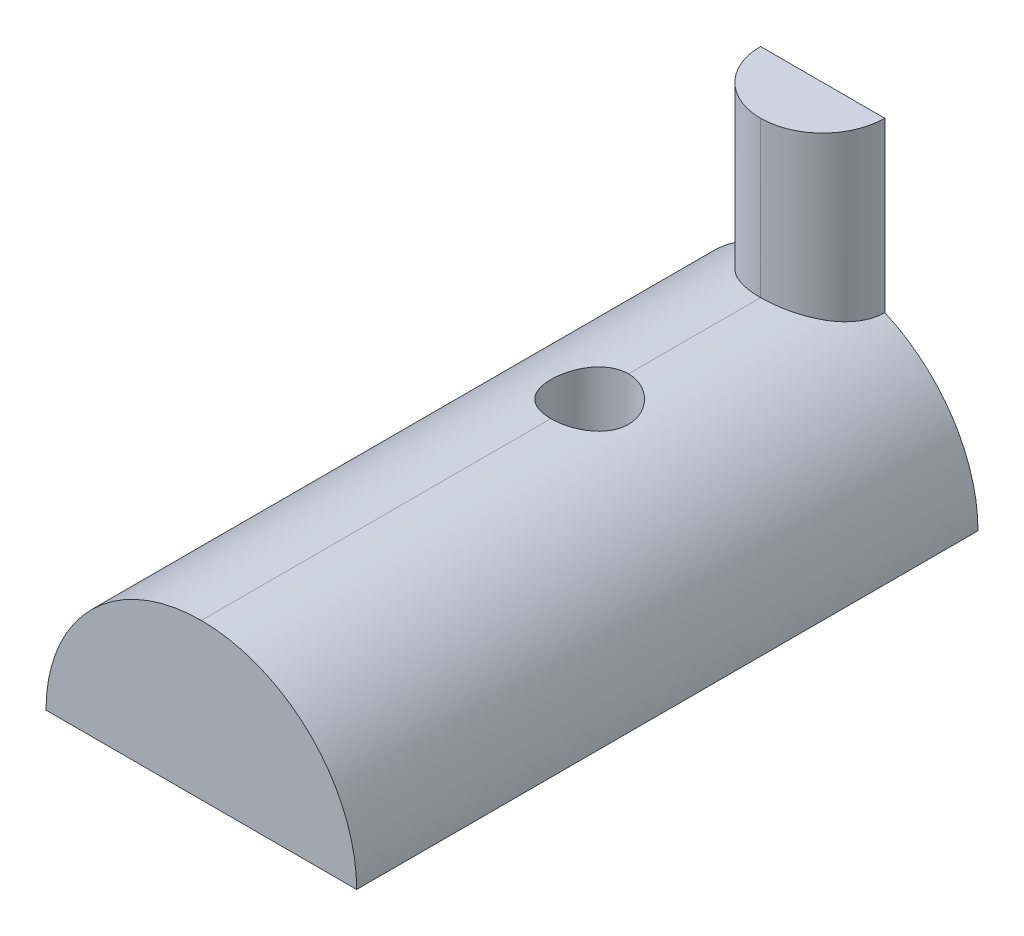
ISO-10303-21;
HEADER;
FILE_DESCRIPTION(('STEP AP214'),'2;1');
FILE_NAME('part.step','',(''),(''),'','','');
FILE_SCHEMA(('AUTOMOTIVE_DESIGN { 1 0 10303 214 1 1 1 1 }'));
ENDSEC;
DATA;
#1=APPLICATION_CONTEXT('core data for automotive mechanical design processes');
#2=APPLICATION_PROTOCOL_DEFINITION('international standard','automotive_design',2000,#1);
#3=PRODUCT_CONTEXT('',#1,'mechanical');
#4=PRODUCT('Part','Part','',(#3));
#5=PRODUCT_RELATED_PRODUCT_CATEGORY('part','',(#4));
#6=PRODUCT_DEFINITION_FORMATION('','',#4);
#7=PRODUCT_DEFINITION_CONTEXT('part definition',#1,'design');
#8=PRODUCT_DEFINITION('design','',#6,#7);
#9=PRODUCT_DEFINITION_SHAPE('','',#8);
#10=(LENGTH_UNIT() NAMED_UNIT(*) SI_UNIT(.MILLI.,.METRE.));
#11=(NAMED_UNIT(*) PLANE_ANGLE_UNIT() SI_UNIT($,.RADIAN.));
#12=(NAMED_UNIT(*) SI_UNIT($,.STERADIAN.) SOLID_ANGLE_UNIT());
#13=UNCERTAINTY_MEASURE_WITH_UNIT(LENGTH_MEASURE(1.E-05),#10,'distance_accuracy_value','');
#14=(GEOMETRIC_REPRESENTATION_CONTEXT(3) GLOBAL_UNCERTAINTY_ASSIGNED_CONTEXT((#13)) GLOBAL_UNIT_ASSIGNED_CONTEXT((#10,
#11,#12)) REPRESENTATION_CONTEXT('',''));
#15=CARTESIAN_POINT('',(0.,0.,0.));
#16=DIRECTION('',(0.,0.,1.));
#17=DIRECTION('',(1.,0.,0.));
#18=AXIS2_PLACEMENT_3D('',#15,#16,#17);
#19=CARTESIAN_POINT('',(0.,2540.,0.));
#20=DIRECTION('',(0.,-1.,0.));
#21=DIRECTION('',(0.,0.,-1.));
#22=AXIS2_PLACEMENT_3D('',#19,#20,#21);
#23=CYLINDRICAL_SURFACE('',#22,508.);
#24=CARTESIAN_POINT('',(508.,1163.97422651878,1.77635683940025E-12));
#25=CARTESIAN_POINT('',(508.000002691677,1163.97421948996,3.41657036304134));
#26=CARTESIAN_POINT('',(507.96553124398,1163.98927063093,6.83303695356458));
#27=CARTESIAN_POINT('',(507.827685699,1164.04941899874,13.6642900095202));
#28=CARTESIAN_POINT('',(507.724312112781,1164.09451600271,17.0790764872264));
#29=CARTESIAN_POINT('',(507.310928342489,1164.27476094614,27.318225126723));
#30=CARTESIAN_POINT('',(506.897655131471,1164.45486283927,34.1379353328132));
#31=CARTESIAN_POINT('',(505.797076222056,1164.93333604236,47.7484560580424));
#32=CARTESIAN_POINT('',(505.109872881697,1165.23166317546,54.5392764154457));
#33=CARTESIAN_POINT('',(503.875094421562,1165.76587971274,64.6956183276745));
#34=CARTESIAN_POINT('',(503.429498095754,1165.95840961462,68.0761329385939));
#35=CARTESIAN_POINT('',(502.470583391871,1166.37197565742,74.8260226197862));
#36=CARTESIAN_POINT('',(501.957260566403,1166.59301367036,78.195396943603));
#37=CARTESIAN_POINT('',(500.320603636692,1167.29632361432,88.2573007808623));
#38=CARTESIAN_POINT('',(499.097253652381,1167.820235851,94.9309441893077));
#39=CARTESIAN_POINT('',(496.386406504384,1168.9750659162,108.215019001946));
#40=CARTESIAN_POINT('',(494.898907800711,1169.60598436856,114.825450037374));
#41=CARTESIAN_POINT('',(492.472444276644,1170.62874519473,124.685008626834));
#42=CARTESIAN_POINT('',(491.631021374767,1170.98242346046,127.96240789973));
#43=CARTESIAN_POINT('',(489.883670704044,1171.71450726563,134.496939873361));
#44=CARTESIAN_POINT('',(488.977747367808,1172.09291110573,137.754073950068));
#45=CARTESIAN_POINT('',(486.163889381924,1173.26416734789,147.493541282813));
#46=CARTESIAN_POINT('',(484.159831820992,1174.09307924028,153.94408152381));
#47=CARTESIAN_POINT('',(479.902748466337,1175.83954560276,166.741654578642));
#48=CARTESIAN_POINT('',(477.650011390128,1176.75699712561,173.088797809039));
#49=CARTESIAN_POINT('',(472.898571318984,1178.67446906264,185.677688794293));
#50=CARTESIAN_POINT('',(470.399868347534,1179.67448946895,191.919436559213));
#51=CARTESIAN_POINT('',(465.161723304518,1181.74976471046,204.288221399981));
#52=CARTESIAN_POINT('',(462.422284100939,1182.82501864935,210.415259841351));
#53=CARTESIAN_POINT('',(456.708029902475,1185.04310814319,222.546015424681));
#54=CARTESIAN_POINT('',(453.733214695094,1186.18594375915,228.549732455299));
#55=CARTESIAN_POINT('',(447.550882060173,1188.53235046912,240.431052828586));
#56=CARTESIAN_POINT('',(444.34316396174,1189.73597365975,246.308541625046));
#57=CARTESIAN_POINT('',(439.36328176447,1191.5800600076,255.019794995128));
#58=CARTESIAN_POINT('',(437.675252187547,1192.20120389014,257.906078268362));
#59=CARTESIAN_POINT('',(434.243631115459,1193.45540613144,263.64301907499));
#60=CARTESIAN_POINT('',(432.500036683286,1194.08846511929,266.493674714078));
#61=CARTESIAN_POINT('',(427.187130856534,1196.00390075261,274.990514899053));
#62=CARTESIAN_POINT('',(423.535521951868,1197.30260102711,280.581878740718));
#63=CARTESIAN_POINT('',(416.018946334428,1199.93503733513,291.610654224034));
#64=CARTESIAN_POINT('',(412.153976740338,1201.26877384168,297.048063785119));
#65=CARTESIAN_POINT('',(404.012474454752,1204.03211589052,308.037418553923));
#66=CARTESIAN_POINT('',(399.724999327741,1205.46312773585,313.580910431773));
#67=CARTESIAN_POINT('',(390.927093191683,1208.3449152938,324.482776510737));
#68=CARTESIAN_POINT('',(386.416660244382,1209.79569117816,329.841149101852));
#69=CARTESIAN_POINT('',(377.179505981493,1212.70733150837,340.365457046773));
#70=CARTESIAN_POINT('',(372.452778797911,1214.16819622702,345.53138717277));
#71=CARTESIAN_POINT('',(362.789808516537,1217.09039507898,355.663548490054));
#72=CARTESIAN_POINT('',(357.853566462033,1218.55172920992,360.629780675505));
#73=CARTESIAN_POINT('',(350.297111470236,1220.73699580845,367.924171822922));
#74=CARTESIAN_POINT('',(347.752580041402,1221.46439626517,370.330133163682));
#75=CARTESIAN_POINT('',(342.613932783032,1222.91570469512,375.089264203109));
#76=CARTESIAN_POINT('',(340.019819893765,1223.63961287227,377.44243701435));
#77=CARTESIAN_POINT('',(332.164116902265,1225.80443174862,384.421737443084));
#78=CARTESIAN_POINT('',(326.829045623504,1227.23847067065,388.967759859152));
#79=CARTESIAN_POINT('',(315.970969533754,1230.07879425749,397.838531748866));
#80=CARTESIAN_POINT('',(310.447961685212,1231.48507847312,402.163277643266));
#81=CARTESIAN_POINT('',(299.221543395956,1234.26087246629,410.584588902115));
#82=CARTESIAN_POINT('',(293.518131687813,1235.63038198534,414.681152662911));
#83=CARTESIAN_POINT('',(281.709508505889,1238.37713969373,422.79675117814));
#84=CARTESIAN_POINT('',(275.597331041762,1239.75254387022,426.806280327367));
#85=CARTESIAN_POINT('',(263.196175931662,1242.44437757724,434.563301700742));
#86=CARTESIAN_POINT('',(256.907197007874,1243.76080668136,438.310792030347));
#87=CARTESIAN_POINT('',(244.162243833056,1246.32541982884,445.536149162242));
#88=CARTESIAN_POINT('',(237.706262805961,1247.57360109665,449.01400500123));
#89=CARTESIAN_POINT('',(224.638225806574,1249.99272912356,455.692341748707));
#90=CARTESIAN_POINT('',(218.026170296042,1251.16367611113,458.8928234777));
#91=CARTESIAN_POINT('',(204.659412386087,1253.41950242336,465.008090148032));
#92=CARTESIAN_POINT('',(197.904756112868,1254.50440905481,467.922965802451));
#93=CARTESIAN_POINT('',(184.262740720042,1256.58061626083,473.461123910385));
#94=CARTESIAN_POINT('',(177.375381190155,1257.57191654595,476.084405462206));
#95=CARTESIAN_POINT('',(163.481065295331,1259.45348715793,481.032558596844));
#96=CARTESIAN_POINT('',(156.474114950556,1260.34376255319,483.357445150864));
#97=CARTESIAN_POINT('',(142.353770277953,1262.01661911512,487.702746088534));
#98=CARTESIAN_POINT('',(135.24037718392,1262.79920152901,489.72316399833));
#99=CARTESIAN_POINT('',(121.267982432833,1264.21555557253,493.363602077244));
#100=CARTESIAN_POINT('',(114.413338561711,1264.85469753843,494.998271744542));
#101=CARTESIAN_POINT('',(100.63321057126,1266.02558048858,497.982584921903));
#102=CARTESIAN_POINT('',(93.7077271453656,1266.55732252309,499.332231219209));
#103=CARTESIAN_POINT('',(79.7992406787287,1267.50963241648,501.742856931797));
#104=CARTESIAN_POINT('',(72.8162387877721,1267.93020249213,502.803842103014));
#105=CARTESIAN_POINT('',(58.8061858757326,1268.65717769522,504.634263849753));
#106=CARTESIAN_POINT('',(51.7791347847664,1268.9635826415,505.40369996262));
#107=CARTESIAN_POINT('',(37.6970531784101,1269.45994620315,506.648676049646));
#108=CARTESIAN_POINT('',(30.6420316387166,1269.64993954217,507.12430366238));
#109=CARTESIAN_POINT('',(16.5160751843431,1269.91224968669,507.780673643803));
#110=CARTESIAN_POINT('',(9.44514023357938,1269.98456622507,507.961415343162));
#111=CARTESIAN_POINT('',(-4.69810803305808,1270.01099788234,508.02749487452));
#112=CARTESIAN_POINT('',(-11.7704213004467,1269.96511659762,507.9128416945));
#113=CARTESIAN_POINT('',(-25.9022950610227,1269.75549135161,507.388476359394));
#114=CARTESIAN_POINT('',(-32.9618556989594,1269.59174873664,506.978767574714));
#115=CARTESIAN_POINT('',(-46.6574628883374,1269.16009440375,505.896803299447));
#116=CARTESIAN_POINT('',(-53.2949871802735,1268.89856294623,505.240619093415));
#117=CARTESIAN_POINT('',(-66.5342551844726,1268.27327843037,503.668173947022));
#118=CARTESIAN_POINT('',(-73.1359992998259,1267.90952652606,502.751915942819));
#119=CARTESIAN_POINT('',(-86.291918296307,1267.08213797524,500.661627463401));
#120=CARTESIAN_POINT('',(-92.8460953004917,1266.61850581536,499.487608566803));
#121=CARTESIAN_POINT('',(-105.895982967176,1265.5942787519,496.88460417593));
#122=CARTESIAN_POINT('',(-112.39169343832,1265.03368353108,495.45561784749));
#123=CARTESIAN_POINT('',(-125.313837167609,1263.81903671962,492.346022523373));
#124=CARTESIAN_POINT('',(-131.74026956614,1263.16498397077,490.665410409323));
#125=CARTESIAN_POINT('',(-144.513306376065,1261.76748280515,487.056411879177));
#126=CARTESIAN_POINT('',(-150.859910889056,1261.02403450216,485.128025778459));
#127=CARTESIAN_POINT('',(-163.46341065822,1259.45227951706,481.027680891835));
#128=CARTESIAN_POINT('',(-169.720304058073,1258.62397108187,478.855717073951));
#129=CARTESIAN_POINT('',(-182.134696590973,1256.88751935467,474.272846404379));
#130=CARTESIAN_POINT('',(-188.292195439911,1255.97937583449,471.861938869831));
#131=CARTESIAN_POINT('',(-200.590404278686,1254.0744746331,466.768091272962));
#132=CARTESIAN_POINT('',(-206.729472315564,1253.07659064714,464.081608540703));
#133=CARTESIAN_POINT('',(-218.886814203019,1251.01022427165,458.472875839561));
#134=CARTESIAN_POINT('',(-224.905087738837,1249.94174169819,455.550625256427));
#135=CARTESIAN_POINT('',(-236.812264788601,1247.74060127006,449.475941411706));
#136=CARTESIAN_POINT('',(-242.701168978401,1246.60794375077,446.323509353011));
#137=CARTESIAN_POINT('',(-254.341559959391,1244.28517431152,439.794160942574));
#138=CARTESIAN_POINT('',(-260.093046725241,1243.09506238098,436.417244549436));
#139=CARTESIAN_POINT('',(-271.452525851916,1240.66404515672,429.443774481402));
#140=CARTESIAN_POINT('',(-277.060478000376,1239.42312587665,425.847160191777));
#141=CARTESIAN_POINT('',(-288.123944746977,1236.89805044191,418.441041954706));
#142=CARTESIAN_POINT('',(-293.579459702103,1235.6138943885,414.631538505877));
#143=CARTESIAN_POINT('',(-304.331335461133,1233.00974663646,406.805422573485));
#144=CARTESIAN_POINT('',(-309.627691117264,1231.68975378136,402.788803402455));
#145=CARTESIAN_POINT('',(-320.054421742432,1229.02161424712,394.554558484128));
#146=CARTESIAN_POINT('',(-325.184795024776,1227.67346728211,390.336930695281));
#147=CARTESIAN_POINT('',(-335.604470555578,1224.86759529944,381.423223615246));
#148=CARTESIAN_POINT('',(-340.882104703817,1223.40848561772,376.713910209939));
#149=CARTESIAN_POINT('',(-348.645804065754,1221.20978558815,369.489650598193));
#150=CARTESIAN_POINT('',(-351.208286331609,1220.47520076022,367.054807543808));
#151=CARTESIAN_POINT('',(-356.281718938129,1219.00381994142,362.132337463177));
#152=CARTESIAN_POINT('',(-358.792666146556,1218.26702381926,359.644707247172));
#153=CARTESIAN_POINT('',(-366.24659081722,1216.05522059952,352.104239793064));
#154=CARTESIAN_POINT('',(-371.110861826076,1214.57873887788,346.97362986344));
#155=CARTESIAN_POINT('',(-380.621889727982,1211.63186002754,336.51292467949));
#156=CARTESIAN_POINT('',(-385.268646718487,1210.16146289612,331.182829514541));
#157=CARTESIAN_POINT('',(-392.071326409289,1207.96761405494,323.042705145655));
#158=CARTESIAN_POINT('',(-394.311563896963,1207.23809197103,320.304401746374));
#159=CARTESIAN_POINT('',(-398.734869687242,1205.78436009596,314.780910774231));
#160=CARTESIAN_POINT('',(-400.917941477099,1205.0601499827,311.995726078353));
#161=CARTESIAN_POINT('',(-407.380408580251,1202.89726991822,303.570923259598));
#162=CARTESIAN_POINT('',(-411.573158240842,1201.46831706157,297.861933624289));
#163=CARTESIAN_POINT('',(-419.720052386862,1198.64659643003,286.267844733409));
#164=CARTESIAN_POINT('',(-423.674199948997,1197.25382818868,280.382747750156));
#165=CARTESIAN_POINT('',(-431.337318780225,1194.514409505,268.444458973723));
#166=CARTESIAN_POINT('',(-435.046288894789,1193.16775927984,262.391266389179));
#167=CARTESIAN_POINT('',(-442.315595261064,1190.49248002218,249.948626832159));
#168=CARTESIAN_POINT('',(-445.868558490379,1189.16549118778,243.554517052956));
#169=CARTESIAN_POINT('',(-452.700452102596,1186.58149306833,230.607621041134));
#170=CARTESIAN_POINT('',(-455.979380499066,1185.32448429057,224.054833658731));
#171=CARTESIAN_POINT('',(-462.256400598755,1182.89067703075,210.800372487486));
#172=CARTESIAN_POINT('',(-465.25445529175,1181.71388912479,204.098679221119));
#173=CARTESIAN_POINT('',(-470.962190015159,1179.45073729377,190.558631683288));
#174=CARTESIAN_POINT('',(-473.671872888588,1178.36437247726,183.720278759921));
#175=CARTESIAN_POINT('',(-478.792229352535,1176.29316821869,169.929454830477));
#176=CARTESIAN_POINT('',(-481.203352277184,1175.30817659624,162.977173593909));
#177=CARTESIAN_POINT('',(-485.725090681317,1173.44668208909,148.960939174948));
#178=CARTESIAN_POINT('',(-487.835697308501,1172.57018240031,141.896982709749));
#179=CARTESIAN_POINT('',(-491.749625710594,1170.93415830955,127.674148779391));
#180=CARTESIAN_POINT('',(-493.553068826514,1170.17458772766,120.515310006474));
#181=CARTESIAN_POINT('',(-496.848258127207,1168.77928346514,106.114810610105));
#182=CARTESIAN_POINT('',(-498.340039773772,1168.14353569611,98.8731595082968));
#183=CARTESIAN_POINT('',(-500.364649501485,1167.277077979,87.8288475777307));
#184=CARTESIAN_POINT('',(-501.013155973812,1166.99882215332,84.050711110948));
#185=CARTESIAN_POINT('',(-502.224794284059,1166.47790049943,76.478461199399));
#186=CARTESIAN_POINT('',(-502.787930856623,1166.23523269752,72.6843486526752));
#187=CARTESIAN_POINT('',(-503.828237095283,1165.7861845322,65.0831744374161));
#188=CARTESIAN_POINT('',(-504.305427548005,1165.57979539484,61.2761161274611));
#189=CARTESIAN_POINT('',(-505.173597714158,1165.20378476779,53.6503714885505));
#190=CARTESIAN_POINT('',(-505.564577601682,1165.03416320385,49.8316851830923));
#191=CARTESIAN_POINT('',(-506.259764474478,1164.73224156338,42.1873388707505));
#192=CARTESIAN_POINT('',(-506.564025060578,1164.59991843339,38.3616846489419));
#193=CARTESIAN_POINT('',(-507.085824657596,1164.37281265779,30.7033728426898));
#194=CARTESIAN_POINT('',(-507.303364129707,1164.27802981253,26.8707152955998));
#195=CARTESIAN_POINT('',(-507.651575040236,1164.12624596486,19.1995729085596));
#196=CARTESIAN_POINT('',(-507.782220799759,1164.06925613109,15.3610866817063));
#197=CARTESIAN_POINT('',(-507.956440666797,1163.99323693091,7.6817343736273));
#198=CARTESIAN_POINT('',(-508.000014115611,1163.97420785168,3.8408682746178));
#199=CARTESIAN_POINT('',(-508.,1163.97422651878,1.75303813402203E-12));
#200=B_SPLINE_CURVE_WITH_KNOTS('',3,(#24,#25,#26,#27,#28,#29,#30,#31,#32,#33,#34,#35,#36,#37,
#38,#39,#40,#41,#42,#43,#44,#45,#46,#47,#48,#49,#50,#51,#52,#53,#54,#55,#56,#57,#58,#59,#60,#61,
#62,#63,#64,#65,#66,#67,#68,#69,#70,#71,#72,#73,#74,#75,#76,#77,#78,#79,#80,#81,#82,#83,#84,#85,
#86,#87,#88,#89,#90,#91,#92,#93,#94,#95,#96,#97,#98,#99,#100,#101,#102,#103,#104,#105,#106,#107,
#108,#109,#110,#111,#112,#113,#114,#115,#116,#117,#118,#119,#120,#121,#122,#123,#124,#125,#126,
#127,#128,#129,#130,#131,#132,#133,#134,#135,#136,#137,#138,#139,#140,#141,#142,#143,#144,#145,
#146,#147,#148,#149,#150,#151,#152,#153,#154,#155,#156,#157,#158,#159,#160,#161,#162,#163,#164,
#165,#166,#167,#168,#169,#170,#171,#172,#173,#174,#175,#176,#177,#178,#179,#180,#181,#182,#183,
#184,#185,#186,#187,#188,#189,#190,#191,#192,#193,#194,#195,#196,#197,#198,#199),.UNSPECIFIED.,
.F.,.F.,(4,2,2,2,2,2,2,2,2,2,2,2,2,2,2,2,2,2,2,2,2,2,2,2,2,2,2,2,2,2,2,2,2,2,2,2,2,2,2,2,2,2,2,
2,2,2,2,2,2,2,2,2,2,2,2,2,2,2,2,2,2,2,2,2,2,2,2,2,2,2,2,2,2,2,2,2,2,2,2,2,2,2,2,2,2,2,2,4),(0.,
10.2492969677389,20.498517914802,40.995284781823,61.4843998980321,71.7292542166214,
81.9747816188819,102.383189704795,122.791716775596,132.997410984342,143.202404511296,
163.611951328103,183.99804699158,204.38414070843,224.769991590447,245.155860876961,
265.559508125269,275.76153902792,285.964110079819,306.368177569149,326.772520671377,
348.224500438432,369.676666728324,391.129415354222,412.582057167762,423.311362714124,
434.040033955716,455.496879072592,476.954071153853,498.411414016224,520.719075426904,
543.026898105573,565.335627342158,587.644290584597,609.945845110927,632.247468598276,
654.547972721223,676.848218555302,698.068784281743,719.289142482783,740.509077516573,
761.729046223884,782.942682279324,804.156366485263,825.369405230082,846.582201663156,
866.601318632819,886.620209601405,906.638201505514,926.656258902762,946.674564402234,
966.69284442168,986.711538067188,1006.73028892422,1027.0497859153,1047.36933584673,
1067.68877959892,1088.00822709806,1108.33330628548,1128.65833787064,1148.98402613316,
1169.3099208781,1190.96982650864,1201.80013761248,1212.63110503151,1234.29215947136,
1255.95320420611,1266.78962665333,1277.62538650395,1299.29641632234,1320.96716663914,
1342.63801899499,1364.93394851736,1387.23003964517,1409.52906456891,1431.82786962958,
1454.09269611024,1476.35817830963,1498.6148443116,1520.86897650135,1532.39844988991,
1543.92728361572,1555.45332526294,1566.97934363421,1578.49822229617,1590.01703969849,
1601.53925963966,1613.06156674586),.UNSPECIFIED.);
#201=CARTESIAN_POINT('',(0.,1270.,508.));
#202=VERTEX_POINT('',#201);
#203=CARTESIAN_POINT('',(-508.,1163.97422651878,0.));
#204=VERTEX_POINT('',#203);
#205=EDGE_CURVE('E112',#202,#204,#200,.T.);
#206=ORIENTED_EDGE('',*,*,#205,.F.);
#207=DIRECTION('',(0.,1.,0.));
#208=VECTOR('',#207,1.);
#209=CARTESIAN_POINT('',(0.,2540.,508.));
#210=LINE('',#209,#208);
#211=CARTESIAN_POINT('',(0.,2540.,508.));
#212=VERTEX_POINT('',#211);
#213=EDGE_CURVE('E12',#202,#212,#210,.T.);
#214=ORIENTED_EDGE('',*,*,#213,.T.);
#215=CARTESIAN_POINT('',(0.,2540.,0.));
#216=DIRECTION('',(0.,-1.,0.));
#217=DIRECTION('',(0.,0.,-1.));
#218=AXIS2_PLACEMENT_3D('',#215,#216,#217);
#219=CIRCLE('',#218,508.);
#220=CARTESIAN_POINT('',(-508.,2540.,0.));
#221=VERTEX_POINT('',#220);
#222=EDGE_CURVE('E87',#212,#221,#219,.T.);
#223=ORIENTED_EDGE('',*,*,#222,.T.);
#224=DIRECTION('',(0.,-1.,0.));
#225=VECTOR('',#224,1.);
#226=CARTESIAN_POINT('',(-508.,2540.,0.));
#227=LINE('',#226,#225);
#228=EDGE_CURVE('E89',#221,#204,#227,.T.);
#229=ORIENTED_EDGE('',*,*,#228,.T.);
#230=EDGE_LOOP('',(#206,#214,#223,#229));
#231=FACE_BOUND('',#230,.T.);
#232=ADVANCED_FACE('F34',(#231),#23,.T.);
#233=CARTESIAN_POINT('',(0.,0.,5080.));
#234=DIRECTION('',(0.,0.,-1.));
#235=DIRECTION('',(-1.,0.,0.));
#236=AXIS2_PLACEMENT_3D('',#233,#234,#235);
#237=CYLINDRICAL_SURFACE('',#236,1270.);
#238=CARTESIAN_POINT('',(0.,1270.,1587.5));
#239=CARTESIAN_POINT('',(4.38598745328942,1269.99999869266,1587.50000235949));
#240=CARTESIAN_POINT('',(8.77206841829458,1269.97726514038,1587.59090207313));
#241=CARTESIAN_POINT('',(17.5363138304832,1269.88648495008,1587.95431701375));
#242=CARTESIAN_POINT('',(21.9144780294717,1269.81843691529,1588.22683783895));
#243=CARTESIAN_POINT('',(30.6552939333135,1269.63749282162,1588.95295145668));
#244=CARTESIAN_POINT('',(35.0179440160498,1269.52459220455,1589.40656265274));
#245=CARTESIAN_POINT('',(43.7193281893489,1269.25472903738,1590.49388809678));
#246=CARTESIAN_POINT('',(48.0580624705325,1269.09776683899,1591.12760090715));
#247=CARTESIAN_POINT('',(56.7060487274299,1268.74077826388,1592.57416261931));
#248=CARTESIAN_POINT('',(61.01528458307,1268.54073002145,1593.3871024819));
#249=CARTESIAN_POINT('',(69.5943598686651,1268.09900016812,1595.19023879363));
#250=CARTESIAN_POINT('',(73.8641992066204,1267.85731846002,1596.1804356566));
#251=CARTESIAN_POINT('',(82.3568088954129,1267.33399515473,1598.33601734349));
#252=CARTESIAN_POINT('',(86.5795806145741,1267.05235472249,1599.50139706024));
#253=CARTESIAN_POINT('',(94.9708141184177,1266.45104061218,1602.00500874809));
#254=CARTESIAN_POINT('',(99.1392759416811,1266.13136696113,1603.34324059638));
#255=CARTESIAN_POINT('',(107.40967384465,1265.45657963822,1606.18816624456));
#256=CARTESIAN_POINT('',(111.511684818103,1265.10150963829,1607.69465272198));
#257=CARTESIAN_POINT('',(119.647430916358,1264.3580103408,1610.87448638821));
#258=CARTESIAN_POINT('',(123.68116604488,1263.96958104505,1612.54783356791));
#259=CARTESIAN_POINT('',(131.673634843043,1263.16197976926,1616.05821594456));
#260=CARTESIAN_POINT('',(135.632368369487,1262.74280773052,1617.89525145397));
#261=CARTESIAN_POINT('',(143.468310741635,1261.87653207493,1621.72959926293));
#262=CARTESIAN_POINT('',(147.34551956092,1261.42942844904,1623.72691161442));
#263=CARTESIAN_POINT('',(155.012103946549,1260.51027493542,1627.87818555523));
#264=CARTESIAN_POINT('',(158.801479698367,1260.03822510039,1630.03214681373));
#265=CARTESIAN_POINT('',(166.286319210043,1259.0723169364,1634.49290142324));
#266=CARTESIAN_POINT('',(169.981783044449,1258.57845862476,1636.79969465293));
#267=CARTESIAN_POINT('',(177.272966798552,1257.57220036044,1641.56214013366));
#268=CARTESIAN_POINT('',(180.86868570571,1257.05980021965,1644.01779389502));
#269=CARTESIAN_POINT('',(187.954677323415,1256.01984970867,1649.07377428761));
#270=CARTESIAN_POINT('',(191.444949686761,1255.49229928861,1651.67410139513));
#271=CARTESIAN_POINT('',(198.378114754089,1254.41566367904,1657.064504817));
#272=CARTESIAN_POINT('',(201.818936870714,1253.86636065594,1659.85720127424));
#273=CARTESIAN_POINT('',(208.57993085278,1252.75941304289,1665.58344284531));
#274=CARTESIAN_POINT('',(211.900102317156,1252.20176842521,1668.51698842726));
#275=CARTESIAN_POINT('',(218.414426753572,1251.0819562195,1674.52005150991));
#276=CARTESIAN_POINT('',(221.608578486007,1250.51978858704,1677.58957034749));
#277=CARTESIAN_POINT('',(227.865613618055,1249.39480008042,1683.85948423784));
#278=CARTESIAN_POINT('',(230.928497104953,1248.83197920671,1687.05987920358));
#279=CARTESIAN_POINT('',(236.918288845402,1247.70950550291,1693.58667097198));
#280=CARTESIAN_POINT('',(239.845182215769,1247.14985302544,1696.91308149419));
#281=CARTESIAN_POINT('',(245.557766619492,1246.03766043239,1703.68616464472));
#282=CARTESIAN_POINT('',(248.343457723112,1245.48512031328,1707.13283721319));
#283=CARTESIAN_POINT('',(253.768955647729,1244.39100599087,1714.14087818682));
#284=CARTESIAN_POINT('',(256.408761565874,1243.84943185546,1717.7022473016));
#285=CARTESIAN_POINT('',(261.537941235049,1242.78106201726,1724.93388259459));
#286=CARTESIAN_POINT('',(264.027314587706,1242.25426635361,1728.60414906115));
#287=CARTESIAN_POINT('',(268.88721239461,1241.21147898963,1736.10306026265));
#288=CARTESIAN_POINT('',(271.25541313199,1240.69576525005,1739.93325004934));
#289=CARTESIAN_POINT('',(275.828001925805,1239.68721666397,1747.69315151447));
#290=CARTESIAN_POINT('',(278.032389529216,1239.19438188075,1751.62286346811));
#291=CARTESIAN_POINT('',(282.273215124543,1238.23525978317,1759.57514625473));
#292=CARTESIAN_POINT('',(284.309650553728,1237.76897287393,1763.59771850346));
#293=CARTESIAN_POINT('',(288.210585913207,1236.8664707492,1771.72869551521));
#294=CARTESIAN_POINT('',(290.075086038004,1236.43025549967,1775.83710018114));
#295=CARTESIAN_POINT('',(293.628234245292,1235.59127229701,1784.13203394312));
#296=CARTESIAN_POINT('',(295.316903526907,1235.18850031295,1788.31855354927));
#297=CARTESIAN_POINT('',(298.515208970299,1234.41944876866,1796.76274521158));
#298=CARTESIAN_POINT('',(300.024844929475,1234.05316924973,1801.02041734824));
#299=CARTESIAN_POINT('',(302.861903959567,1233.35996357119,1809.59912218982));
#300=CARTESIAN_POINT('',(304.189330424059,1233.03303667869,1813.92015371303));
#301=CARTESIAN_POINT('',(306.659165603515,1232.42110300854,1822.61770372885));
#302=CARTESIAN_POINT('',(307.80157510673,1232.1360960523,1826.99422198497));
#303=CARTESIAN_POINT('',(309.877880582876,1231.61553316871,1835.70642899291));
#304=CARTESIAN_POINT('',(310.815494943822,1231.37910103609,1840.04117953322));
#305=CARTESIAN_POINT('',(312.508658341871,1230.95048696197,1848.74826015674));
#306=CARTESIAN_POINT('',(313.264208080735,1230.7583048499,1853.12059009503));
#307=CARTESIAN_POINT('',(314.591602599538,1230.41968160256,1861.89477433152));
#308=CARTESIAN_POINT('',(315.163448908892,1230.27324008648,1866.29662838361));
#309=CARTESIAN_POINT('',(316.122191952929,1230.02723742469,1875.12174403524));
#310=CARTESIAN_POINT('',(316.509088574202,1229.92767630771,1879.5450056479));
#311=CARTESIAN_POINT('',(317.097033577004,1229.77622497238,1888.40404938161));
#312=CARTESIAN_POINT('',(317.298108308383,1229.72432799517,1892.83982963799));
#313=CARTESIAN_POINT('',(317.51405653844,1229.66858802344,1901.71622777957));
#314=CARTESIAN_POINT('',(317.528929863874,1229.66474507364,1906.15684566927));
#315=CARTESIAN_POINT('',(317.372443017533,1229.70514307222,1915.03452213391));
#316=CARTESIAN_POINT('',(317.201085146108,1229.74938342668,1919.47158075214));
#317=CARTESIAN_POINT('',(316.672520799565,1229.88559999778,1928.33386443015));
#318=CARTESIAN_POINT('',(316.315315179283,1229.97757599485,1932.75908954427));
#319=CARTESIAN_POINT('',(315.426774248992,1230.20573680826,1941.4822059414));
#320=CARTESIAN_POINT('',(314.899878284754,1230.34079378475,1945.78057972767));
#321=CARTESIAN_POINT('',(313.671016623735,1230.65466132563,1954.35060285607));
#322=CARTESIAN_POINT('',(312.969051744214,1230.83347168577,1958.62225232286));
#323=CARTESIAN_POINT('',(311.391517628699,1231.23352159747,1967.13127640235));
#324=CARTESIAN_POINT('',(310.515951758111,1231.45476032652,1971.36865167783));
#325=CARTESIAN_POINT('',(308.592989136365,1231.93804621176,1979.80188102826));
#326=CARTESIAN_POINT('',(307.545592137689,1232.20009342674,1983.99773504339));
#327=CARTESIAN_POINT('',(305.281014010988,1232.76310118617,1992.34092791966));
#328=CARTESIAN_POINT('',(304.063825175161,1233.06406349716,1996.48826456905));
#329=CARTESIAN_POINT('',(301.462090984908,1233.70272014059,2004.72722868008));
#330=CARTESIAN_POINT('',(300.077545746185,1234.04041444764,2008.81885618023));
#331=CARTESIAN_POINT('',(297.14374227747,1234.75012610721,2016.93965032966));
#332=CARTESIAN_POINT('',(295.594482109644,1235.12214386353,2020.96881624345));
#333=CARTESIAN_POINT('',(292.334172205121,1235.89786767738,2028.95804226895));
#334=CARTESIAN_POINT('',(290.623122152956,1236.3015737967,2032.91810224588));
#335=CARTESIAN_POINT('',(287.024332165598,1237.14206187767,2040.80224282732));
#336=CARTESIAN_POINT('',(285.13498584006,1237.57913608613,2044.72555903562));
#337=CARTESIAN_POINT('',(281.197881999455,1238.47964407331,2052.48879089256));
#338=CARTESIAN_POINT('',(279.150124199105,1238.94307789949,2056.32870639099));
#339=CARTESIAN_POINT('',(274.899851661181,1239.89306518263,2063.91897571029));
#340=CARTESIAN_POINT('',(272.697336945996,1240.37961863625,2067.66932954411));
#341=CARTESIAN_POINT('',(268.141387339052,1241.37247903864,2075.07452736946));
#342=CARTESIAN_POINT('',(265.787952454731,1241.87878598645,2078.7293713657));
#343=CARTESIAN_POINT('',(260.933818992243,1242.90775926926,2085.93832590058));
#344=CARTESIAN_POINT('',(258.433099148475,1243.43042796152,2089.49242178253));
#345=CARTESIAN_POINT('',(253.288880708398,1244.48850466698,2096.49376856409));
#346=CARTESIAN_POINT('',(250.645382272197,1245.0239126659,2099.94101958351));
#347=CARTESIAN_POINT('',(245.219888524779,1246.10387073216,2106.72336401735));
#348=CARTESIAN_POINT('',(242.437891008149,1246.64842094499,2110.05845564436));
#349=CARTESIAN_POINT('',(236.739915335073,1247.74301383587,2116.61123356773));
#350=CARTESIAN_POINT('',(233.823936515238,1248.29305654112,2119.82891928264));
#351=CARTESIAN_POINT('',(227.777529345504,1249.41070775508,2126.23197332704));
#352=CARTESIAN_POINT('',(224.643355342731,1249.9783694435,2129.41379651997));
#353=CARTESIAN_POINT('',(218.24339297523,1251.11165855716,2135.64260456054));
#354=CARTESIAN_POINT('',(214.977603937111,1251.67728597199,2138.68958871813));
#355=CARTESIAN_POINT('',(208.319763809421,1252.80256790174,2144.64363265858));
#356=CARTESIAN_POINT('',(204.927710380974,1253.36222230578,2147.5506898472));
#357=CARTESIAN_POINT('',(198.023002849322,1254.47164832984,2153.21984992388));
#358=CARTESIAN_POINT('',(194.510348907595,1255.02141996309,2155.98195300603));
#359=CARTESIAN_POINT('',(187.370085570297,1256.10727720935,2161.35652746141));
#360=CARTESIAN_POINT('',(183.742471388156,1256.64336225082,2163.96899259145));
#361=CARTESIAN_POINT('',(176.378437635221,1257.69808848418,2169.03954546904));
#362=CARTESIAN_POINT('',(172.642018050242,1258.2167296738,2171.49763319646));
#363=CARTESIAN_POINT('',(165.066619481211,1259.23294730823,2176.2549829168));
#364=CARTESIAN_POINT('',(161.227640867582,1259.73052382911,2178.55424548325));
#365=CARTESIAN_POINT('',(153.453572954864,1260.70113238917,2182.9897089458));
#366=CARTESIAN_POINT('',(149.518483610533,1261.1741644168,2185.12590976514));
#367=CARTESIAN_POINT('',(141.545071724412,1262.09395588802,2189.23834051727));
#368=CARTESIAN_POINT('',(137.506438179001,1262.54061840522,2191.21398924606));
#369=CARTESIAN_POINT('',(129.346149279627,1263.40270965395,2194.9931753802));
#370=CARTESIAN_POINT('',(125.224493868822,1263.81813836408,2196.7967126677));
#371=CARTESIAN_POINT('',(116.905382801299,1264.61479980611,2200.22809330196));
#372=CARTESIAN_POINT('',(112.707926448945,1264.99603222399,2201.85593503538));
#373=CARTESIAN_POINT('',(104.244753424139,1265.72156061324,2204.93258252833));
#374=CARTESIAN_POINT('',(99.9790367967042,1266.06585660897,2206.38138840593));
#375=CARTESIAN_POINT('',(91.3877308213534,1266.7149788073,2209.09673692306));
#376=CARTESIAN_POINT('',(87.062150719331,1267.0198110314,2210.36330737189));
#377=CARTESIAN_POINT('',(78.3584238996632,1267.5878575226,2212.71175613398));
#378=CARTESIAN_POINT('',(73.9802771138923,1267.85107173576,2213.79363420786));
#379=CARTESIAN_POINT('',(65.1796657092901,1268.33395903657,2215.77033368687));
#380=CARTESIAN_POINT('',(60.7572019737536,1268.55363299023,2216.66515881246));
#381=CARTESIAN_POINT('',(51.8762146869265,1268.94783764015,2218.26580813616));
#382=CARTESIAN_POINT('',(47.4176913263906,1269.12236857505,2218.9716333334));
#383=CARTESIAN_POINT('',(38.5876155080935,1269.42113121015,2220.1770776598));
#384=CARTESIAN_POINT('',(34.2167597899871,1269.54653655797,2220.68151460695));
#385=CARTESIAN_POINT('',(25.4568220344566,1269.75239496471,2221.5083806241));
#386=CARTESIAN_POINT('',(21.0677400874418,1269.83284824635,2221.83081059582));
#387=CARTESIAN_POINT('',(12.279434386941,1269.94823798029,2222.29296750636));
#388=CARTESIAN_POINT('',(7.880210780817,1269.98317508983,2222.43269708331));
#389=CARTESIAN_POINT('',(-0.920373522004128,1270.00728959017,2222.52916056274));
#390=CARTESIAN_POINT('',(-5.32173422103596,1269.99646693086,2222.48589426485));
#391=CARTESIAN_POINT('',(-14.1181323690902,1269.92914056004,2222.2164703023));
#392=CARTESIAN_POINT('',(-18.5131703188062,1269.8726406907,2221.99032802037));
#393=CARTESIAN_POINT('',(-27.2892391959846,1269.71436102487,2221.35565900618));
#394=CARTESIAN_POINT('',(-31.6702701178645,1269.61258121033,2220.94713220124));
#395=CARTESIAN_POINT('',(-40.4103049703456,1269.36445505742,2219.94857288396));
#396=CARTESIAN_POINT('',(-44.7693089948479,1269.21810890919,2219.35854114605));
#397=CARTESIAN_POINT('',(-53.457396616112,1268.88187223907,2217.99822681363));
#398=CARTESIAN_POINT('',(-57.7864802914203,1268.69198183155,2217.22794469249));
#399=CARTESIAN_POINT('',(-66.3428792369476,1268.2731157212,2215.52152850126));
#400=CARTESIAN_POINT('',(-70.5707508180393,1268.04476279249,2214.5880292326));
#401=CARTESIAN_POINT('',(-78.9825972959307,1267.54861866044,2212.54955353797));
#402=CARTESIAN_POINT('',(-83.1665723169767,1267.28082756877,2211.44457759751));
#403=CARTESIAN_POINT('',(-91.4834272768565,1266.70760524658,2209.06535487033));
#404=CARTESIAN_POINT('',(-95.6163079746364,1266.40217457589,2207.79111060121));
#405=CARTESIAN_POINT('',(-103.824078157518,1265.75570604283,2205.07581698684));
#406=CARTESIAN_POINT('',(-107.898967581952,1265.41466814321,2203.6347674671));
#407=CARTESIAN_POINT('',(-115.984261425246,1264.69922252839,2200.58850687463));
#408=CARTESIAN_POINT('',(-119.994661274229,1264.32481246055,2198.98328422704));
#409=CARTESIAN_POINT('',(-127.944102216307,1263.5451148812,2195.61176327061));
#410=CARTESIAN_POINT('',(-131.883143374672,1263.13982739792,2193.84546510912));
#411=CARTESIAN_POINT('',(-139.683558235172,1262.30103046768,2190.15499358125));
#412=CARTESIAN_POINT('',(-143.544930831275,1261.86752061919,2188.23081796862));
#413=CARTESIAN_POINT('',(-151.183796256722,1260.97511764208,2184.22804935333));
#414=CARTESIAN_POINT('',(-154.961288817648,1260.51622443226,2182.14945585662));
#415=CARTESIAN_POINT('',(-162.492660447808,1259.5677016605,2177.80326569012));
#416=CARTESIAN_POINT('',(-166.244931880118,1259.07767125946,2175.53297030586));
#417=CARTESIAN_POINT('',(-173.65036065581,1258.07770537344,2170.84021145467));
#418=CARTESIAN_POINT('',(-177.303517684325,1257.56776982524,2168.41774750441));
#419=CARTESIAN_POINT('',(-184.504883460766,1256.53140897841,2163.42483494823));
#420=CARTESIAN_POINT('',(-188.053091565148,1256.00498357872,2160.85438543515));
#421=CARTESIAN_POINT('',(-195.038886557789,1254.93916878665,2155.56987968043));
#422=CARTESIAN_POINT('',(-198.476473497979,1254.39977940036,2152.85582350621));
#423=CARTESIAN_POINT('',(-205.236083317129,1253.31156193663,2147.28820784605));
#424=CARTESIAN_POINT('',(-208.558088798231,1252.76273245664,2144.43462751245));
#425=CARTESIAN_POINT('',(-215.080721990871,1251.65938811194,2138.59302283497));
#426=CARTESIAN_POINT('',(-218.281349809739,1251.10487325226,2135.60499860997));
#427=CARTESIAN_POINT('',(-224.556179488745,1249.99386982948,2129.49930003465));
#428=CARTESIAN_POINT('',(-227.630379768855,1249.4373812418,2126.38162406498));
#429=CARTESIAN_POINT('',(-233.647396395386,1248.32618107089,2120.02164496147));
#430=CARTESIAN_POINT('',(-236.590212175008,1247.77146949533,2116.7793412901));
#431=CARTESIAN_POINT('',(-242.410386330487,1246.65400179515,2110.09406660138));
#432=CARTESIAN_POINT('',(-245.284356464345,1246.09138319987,2106.64812184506));
#433=CARTESIAN_POINT('',(-250.884427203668,1244.97596597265,2099.63654618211));
#434=CARTESIAN_POINT('',(-253.610527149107,1244.42316738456,2096.07091474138));
#435=CARTESIAN_POINT('',(-258.910130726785,1243.33135733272,2088.82583804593));
#436=CARTESIAN_POINT('',(-261.48363150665,1242.7923461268,2085.14639066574));
#437=CARTESIAN_POINT('',(-266.473386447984,1241.73203233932,2077.6798940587));
#438=CARTESIAN_POINT('',(-268.889640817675,1241.21072973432,2073.89284497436));
#439=CARTESIAN_POINT('',(-273.560456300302,1240.18965958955,2066.21757918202));
#440=CARTESIAN_POINT('',(-275.815020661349,1239.68989161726,2062.32936450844));
#441=CARTESIAN_POINT('',(-280.158304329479,1238.71557599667,2054.4582850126));
#442=CARTESIAN_POINT('',(-282.24702354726,1238.24102836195,2050.47542013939));
#443=CARTESIAN_POINT('',(-286.254601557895,1237.32070632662,2042.42191504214));
#444=CARTESIAN_POINT('',(-288.173462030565,1236.87493164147,2038.35127568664));
#445=CARTESIAN_POINT('',(-291.837581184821,1236.01552079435,2030.12926467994));
#446=CARTESIAN_POINT('',(-293.582840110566,1235.60188458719,2025.97789314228));
#447=CARTESIAN_POINT('',(-296.886310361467,1234.81228766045,2017.62686509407));
#448=CARTESIAN_POINT('',(-298.445580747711,1234.43611585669,2013.42764750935));
#449=CARTESIAN_POINT('',(-301.385955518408,1233.72152256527,2004.96411840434));
#450=CARTESIAN_POINT('',(-302.767060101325,1233.38310103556,2000.69980695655));
#451=CARTESIAN_POINT('',(-305.348229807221,1232.74661862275,1992.1137433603));
#452=CARTESIAN_POINT('',(-306.548294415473,1232.44855785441,1987.79199104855));
#453=CARTESIAN_POINT('',(-308.764824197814,1231.89512070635,1979.098945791));
#454=CARTESIAN_POINT('',(-309.781289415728,1231.63974431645,1974.72765285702));
#455=CARTESIAN_POINT('',(-311.628246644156,1231.17372578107,1965.94441184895));
#456=CARTESIAN_POINT('',(-312.458772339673,1230.96307553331,1961.53247128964));
#457=CARTESIAN_POINT('',(-313.932253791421,1230.58811881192,1952.67540932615));
#458=CARTESIAN_POINT('',(-314.575209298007,1230.42381239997,1948.2302878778));
#459=CARTESIAN_POINT('',(-315.672099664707,1230.14285598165,1939.31537315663));
#460=CARTESIAN_POINT('',(-316.126038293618,1230.02620502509,1934.84558037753));
#461=CARTESIAN_POINT('',(-316.843885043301,1229.8414898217,1925.88977367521));
#462=CARTESIAN_POINT('',(-317.107794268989,1229.77342529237,1921.40375984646));
#463=CARTESIAN_POINT('',(-317.440137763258,1229.68767869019,1912.55325647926));
#464=CARTESIAN_POINT('',(-317.513975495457,1229.66860394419,1908.18898237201));
#465=CARTESIAN_POINT('',(-317.481676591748,1229.67694351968,1899.46116011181));
#466=CARTESIAN_POINT('',(-317.375540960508,1229.70435758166,1895.09761195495));
#467=CARTESIAN_POINT('',(-316.983528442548,1229.80546575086,1886.37922086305));
#468=CARTESIAN_POINT('',(-316.697654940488,1229.87915898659,1882.02437776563));
#469=CARTESIAN_POINT('',(-315.946782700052,1230.07226645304,1873.33117583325));
#470=CARTESIAN_POINT('',(-315.481783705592,1230.19168074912,1868.99281702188));
#471=CARTESIAN_POINT('',(-314.373666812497,1230.47532464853,1860.34051419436));
#472=CARTESIAN_POINT('',(-313.730554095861,1230.63955294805,1856.02656947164));
#473=CARTESIAN_POINT('',(-312.267559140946,1231.0115925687,1847.43065872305));
#474=CARTESIAN_POINT('',(-311.447676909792,1231.21940388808,1843.14869269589));
#475=CARTESIAN_POINT('',(-309.632844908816,1231.67705869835,1834.62428503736));
#476=CARTESIAN_POINT('',(-308.637894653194,1231.92690230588,1830.38184351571));
#477=CARTESIAN_POINT('',(-306.474963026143,1232.46677004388,1821.94389632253));
#478=CARTESIAN_POINT('',(-305.30698180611,1232.7567941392,1817.74839060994));
#479=CARTESIAN_POINT('',(-302.807844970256,1233.37303973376,1809.43651664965));
#480=CARTESIAN_POINT('',(-301.477709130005,1233.69903390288,1805.31982482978));
#481=CARTESIAN_POINT('',(-298.651374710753,1234.38627311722,1797.14684597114));
#482=CARTESIAN_POINT('',(-297.155176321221,1234.74751812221,1793.09055886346));
#483=CARTESIAN_POINT('',(-293.999573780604,1235.50268407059,1785.04512427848));
#484=CARTESIAN_POINT('',(-292.340171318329,1235.89660467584,1781.05597610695));
#485=CARTESIAN_POINT('',(-288.861224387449,1236.71435089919,1773.15126084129));
#486=CARTESIAN_POINT('',(-287.041679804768,1237.13817653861,1769.23569379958));
#487=CARTESIAN_POINT('',(-283.245547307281,1238.01282463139,1761.48401940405));
#488=CARTESIAN_POINT('',(-281.268943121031,1238.46364988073,1757.64792033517));
#489=CARTESIAN_POINT('',(-277.162352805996,1239.38914795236,1750.06167669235));
#490=CARTESIAN_POINT('',(-275.032366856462,1239.86382074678,1746.31153201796));
#491=CARTESIAN_POINT('',(-270.622649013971,1240.83378348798,1738.90299469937));
#492=CARTESIAN_POINT('',(-268.342914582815,1241.32907378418,1735.24460361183));
#493=CARTESIAN_POINT('',(-263.637573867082,1242.3369182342,1728.0252997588));
#494=CARTESIAN_POINT('',(-261.211966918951,1242.84947246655,1724.46438743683));
#495=CARTESIAN_POINT('',(-256.153718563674,1243.90197307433,1717.35391813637));
#496=CARTESIAN_POINT('',(-253.517325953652,1244.44228522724,1713.80708314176));
#497=CARTESIAN_POINT('',(-248.099665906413,1245.53369728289,1706.82754413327));
#498=CARTESIAN_POINT('',(-245.318397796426,1246.08479723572,1703.39484064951));
#499=CARTESIAN_POINT('',(-239.615612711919,1247.19396885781,1696.64905749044));
#500=CARTESIAN_POINT('',(-236.694093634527,1247.75204063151,1693.33597961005));
#501=CARTESIAN_POINT('',(-230.715677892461,1248.87130009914,1686.83486190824));
#502=CARTESIAN_POINT('',(-227.658781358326,1249.43248779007,1683.64682196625));
#503=CARTESIAN_POINT('',(-221.413882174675,1250.55426074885,1677.40023743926));
#504=CARTESIAN_POINT('',(-218.225849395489,1251.11484584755,1674.34172294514));
#505=CARTESIAN_POINT('',(-211.724514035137,1252.23145160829,1668.35999438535));
#506=CARTESIAN_POINT('',(-208.411211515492,1252.78747227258,1665.43678025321));
#507=CARTESIAN_POINT('',(-201.664689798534,1253.89115793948,1659.73051131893));
#508=CARTESIAN_POINT('',(-198.23147070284,1254.43882294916,1656.94745639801));
#509=CARTESIAN_POINT('',(-191.250651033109,1255.52206854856,1651.52619648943));
#510=CARTESIAN_POINT('',(-187.70305011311,1256.05764910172,1648.88799193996));
#511=CARTESIAN_POINT('',(-180.433842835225,1257.12265330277,1643.71444865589));
#512=CARTESIAN_POINT('',(-176.710247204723,1257.65178892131,1641.1818448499));
#513=CARTESIAN_POINT('',(-169.156712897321,1258.69000938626,1636.27609492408));
#514=CARTESIAN_POINT('',(-165.326773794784,1259.19909415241,1633.9029494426));
#515=CARTESIAN_POINT('',(-157.566882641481,1260.19362764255,1629.32041733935));
#516=CARTESIAN_POINT('',(-153.636925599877,1260.67907518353,1627.11103891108));
#517=CARTESIAN_POINT('',(-145.68395588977,1261.62285160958,1622.86038154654));
#518=CARTESIAN_POINT('',(-141.660943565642,1262.08118059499,1620.81910198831));
#519=CARTESIAN_POINT('',(-133.531457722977,1262.96716394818,1616.90985883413));
#520=CARTESIAN_POINT('',(-129.425039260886,1263.39483775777,1615.04178516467));
#521=CARTESIAN_POINT('',(-121.133440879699,1264.21677165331,1611.48118184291));
#522=CARTESIAN_POINT('',(-116.948260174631,1264.61103140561,1609.7886539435));
#523=CARTESIAN_POINT('',(-108.50724736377,1265.36324002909,1606.58283080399));
#524=CARTESIAN_POINT('',(-104.251424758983,1265.72119373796,1605.06951168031));
#525=CARTESIAN_POINT('',(-95.676391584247,1266.3982482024,1602.22503102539));
#526=CARTESIAN_POINT('',(-91.3571834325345,1266.71735043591,1600.89386256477));
#527=CARTESIAN_POINT('',(-83.4830825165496,1267.25809440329,1598.6500726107));
#528=CARTESIAN_POINT('',(-79.9376349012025,1267.48676776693,1597.70585899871));
#529=CARTESIAN_POINT('',(-72.8145498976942,1267.91591623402,1595.94053304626));
#530=CARTESIAN_POINT('',(-69.2369130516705,1268.11639181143,1595.11941863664));
#531=CARTESIAN_POINT('',(-62.0543647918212,1268.48814976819,1593.60157772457));
#532=CARTESIAN_POINT('',(-58.4494571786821,1268.65943614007,1592.90483420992));
#533=CARTESIAN_POINT('',(-51.2163417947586,1268.97202105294,1591.63660398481));
#534=CARTESIAN_POINT('',(-47.588133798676,1269.11331930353,1591.0651184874));
#535=CARTESIAN_POINT('',(-40.3132480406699,1269.36523035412,1590.04828834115));
#536=CARTESIAN_POINT('',(-36.6665714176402,1269.47584502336,1589.60293600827));
#537=CARTESIAN_POINT('',(-29.3591879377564,1269.66586017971,1588.83899136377));
#538=CARTESIAN_POINT('',(-25.6984812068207,1269.74526094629,1588.52039791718));
#539=CARTESIAN_POINT('',(-18.3671844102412,1269.87246956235,1588.01041016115));
#540=CARTESIAN_POINT('',(-14.6965931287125,1269.92027332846,1587.81903229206));
#541=CARTESIAN_POINT('',(-7.35068982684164,1269.98403930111,1587.56382539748));
#542=CARTESIAN_POINT('',(-3.67537774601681,1270.00000109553,1587.49999802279));
#543=CARTESIAN_POINT('',(0.,1270.,1587.5));
#544=B_SPLINE_CURVE_WITH_KNOTS('',3,(#238,#239,#240,#241,#242,#243,#244,#245,#246,#247,#248,
#249,#250,#251,#252,#253,#254,#255,#256,#257,#258,#259,#260,#261,#262,#263,#264,#265,#266,#267,
#268,#269,#270,#271,#272,#273,#274,#275,#276,#277,#278,#279,#280,#281,#282,#283,#284,#285,#286,
#287,#288,#289,#290,#291,#292,#293,#294,#295,#296,#297,#298,#299,#300,#301,#302,#303,#304,#305,
#306,#307,#308,#309,#310,#311,#312,#313,#314,#315,#316,#317,#318,#319,#320,#321,#322,#323,#324,
#325,#326,#327,#328,#329,#330,#331,#332,#333,#334,#335,#336,#337,#338,#339,#340,#341,#342,#343,
#344,#345,#346,#347,#348,#349,#350,#351,#352,#353,#354,#355,#356,#357,#358,#359,#360,#361,#362,
#363,#364,#365,#366,#367,#368,#369,#370,#371,#372,#373,#374,#375,#376,#377,#378,#379,#380,#381,
#382,#383,#384,#385,#386,#387,#388,#389,#390,#391,#392,#393,#394,#395,#396,#397,#398,#399,#400,
#401,#402,#403,#404,#405,#406,#407,#408,#409,#410,#411,#412,#413,#414,#415,#416,#417,#418,#419,
#420,#421,#422,#423,#424,#425,#426,#427,#428,#429,#430,#431,#432,#433,#434,#435,#436,#437,#438,
#439,#440,#441,#442,#443,#444,#445,#446,#447,#448,#449,#450,#451,#452,#453,#454,#455,#456,#457,
#458,#459,#460,#461,#462,#463,#464,#465,#466,#467,#468,#469,#470,#471,#472,#473,#474,#475,#476,
#477,#478,#479,#480,#481,#482,#483,#484,#485,#486,#487,#488,#489,#490,#491,#492,#493,#494,#495,
#496,#497,#498,#499,#500,#501,#502,#503,#504,#505,#506,#507,#508,#509,#510,#511,#512,#513,#514,
#515,#516,#517,#518,#519,#520,#521,#522,#523,#524,#525,#526,#527,#528,#529,#530,#531,#532,#533,
#534,#535,#536,#537,#538,#539,#540,#541,#542,#543),.UNSPECIFIED.,.T.,.F.,(4,2,2,2,2,2,2,2,2,2,2,
2,2,2,2,2,2,2,2,2,2,2,2,2,2,2,2,2,2,2,2,2,2,2,2,2,2,2,2,2,2,2,2,2,2,2,2,2,2,2,2,2,2,2,2,2,2,2,2,
2,2,2,2,2,2,2,2,2,2,2,2,2,2,2,2,2,2,2,2,2,2,2,2,2,2,2,2,2,2,2,2,2,2,2,2,2,2,2,2,2,2,2,2,2,2,2,2,
2,2,2,2,2,2,2,2,2,2,2,2,2,2,2,2,2,2,2,2,2,2,2,2,2,2,2,2,2,2,2,2,2,2,2,2,2,2,2,2,2,2,2,2,2,4),
(0.,13.1571244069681,26.3146543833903,39.4735218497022,52.6322842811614,65.7977404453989,
78.9632273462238,92.128330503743,105.293424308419,118.442471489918,131.591517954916,
144.740589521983,157.889665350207,171.038713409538,184.187751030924,197.33692208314,
210.486136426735,223.878575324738,237.271058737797,250.663673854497,264.056280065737,
277.450348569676,290.844410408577,304.238555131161,317.632735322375,331.22650284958,
344.820307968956,358.414320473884,372.008317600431,385.600673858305,399.19304549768,
412.785163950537,426.3772244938,439.69701955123,453.016763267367,466.336396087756,
479.656037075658,492.973789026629,506.291553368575,519.609153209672,532.926691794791,
545.920818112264,558.914883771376,571.908697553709,584.902530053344,597.896952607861,
610.891366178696,623.885932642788,636.880524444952,650.006029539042,663.131558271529,
676.257085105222,689.382611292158,702.510037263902,715.637448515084,728.765068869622,
741.892754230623,755.395218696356,768.89775225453,782.400536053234,795.903301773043,
809.406630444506,822.909960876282,836.413242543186,849.91653056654,863.466704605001,
877.016887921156,890.567195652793,904.117494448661,917.665723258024,931.213969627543,
944.761946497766,958.309851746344,971.510810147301,984.711703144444,997.912405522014,
1011.11312235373,1024.31272891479,1037.51234073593,1050.71189623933,1063.91141707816,
1076.91478268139,1089.9181114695,1102.92124687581,1115.92439588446,1128.92846230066,
1141.93251682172,1154.93675639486,1167.94103757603,1181.17600876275,1194.41102198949,
1207.64611635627,1220.88120450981,1234.11827632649,1247.35533643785,1260.59256192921,
1273.8298445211,1287.39258261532,1300.95538124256,1314.51843330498,1328.08146740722,
1341.64422897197,1355.20699783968,1368.76963256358,1382.33224821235,1395.8135204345,
1409.29477763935,1422.77607317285,1436.2573654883,1449.73621353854,1463.21507952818,
1476.69367675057,1490.17219560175,1503.26308024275,1516.3538918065,1529.44445686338,
1542.53504063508,1555.62524359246,1568.71544602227,1581.80568477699,1594.89591207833,
1607.90769539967,1620.91946387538,1633.9310977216,1646.94274083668,1659.95573372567,
1672.9687114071,1685.98190971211,1698.99516721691,1712.34806284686,1725.70102049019,
1739.05417840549,1752.40732344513,1765.76355381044,1779.11977761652,1792.47599010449,
1805.83224299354,1819.4308332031,1833.0294778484,1846.62880239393,1860.22807661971,
1873.81864831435,1887.40935570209,1900.99824978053,1914.58662676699,1925.61284919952,
1936.63888627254,1947.66341397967,1958.68804844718,1969.71201114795,1980.73587514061,
1991.76116349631,2002.78659454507),.UNSPECIFIED.);
#545=CARTESIAN_POINT('',(0.,1270.,1587.5));
#546=VERTEX_POINT('',#545);
#547=CARTESIAN_POINT('',(0.,1270.,2222.5));
#548=VERTEX_POINT('',#547);
#549=EDGE_CURVE('E95',#546,#548,#544,.T.);
#550=ORIENTED_EDGE('',*,*,#549,.T.);
#551=DIRECTION('',(0.,0.,1.));
#552=VECTOR('',#551,1.);
#553=CARTESIAN_POINT('',(0.,1270.,5080.));
#554=LINE('',#553,#552);
#555=CARTESIAN_POINT('',(0.,1270.,5080.));
#556=VERTEX_POINT('',#555);
#557=EDGE_CURVE('E43',#548,#556,#554,.T.);
#558=ORIENTED_EDGE('',*,*,#557,.T.);
#559=CARTESIAN_POINT('',(0.,0.,5080.));
#560=DIRECTION('',(0.,0.,1.));
#561=DIRECTION('',(1.,0.,0.));
#562=AXIS2_PLACEMENT_3D('',#559,#560,#561);
#563=CIRCLE('',#562,1270.);
#564=CARTESIAN_POINT('',(1270.,0.,5080.));
#565=VERTEX_POINT('',#564);
#566=EDGE_CURVE('E121',#565,#556,#563,.T.);
#567=ORIENTED_EDGE('',*,*,#566,.F.);
#568=DIRECTION('',(0.,0.,-1.));
#569=VECTOR('',#568,1.);
#570=CARTESIAN_POINT('',(1270.,0.,5080.));
#571=LINE('',#570,#569);
#572=CARTESIAN_POINT('',(1270.,0.,0.));
#573=VERTEX_POINT('',#572);
#574=EDGE_CURVE('E227',#565,#573,#571,.T.);
#575=ORIENTED_EDGE('',*,*,#574,.T.);
#576=CARTESIAN_POINT('',(0.,0.,0.));
#577=DIRECTION('',(0.,0.,1.));
#578=DIRECTION('',(1.,0.,0.));
#579=AXIS2_PLACEMENT_3D('',#576,#577,#578);
#580=CIRCLE('',#579,1270.);
#581=CARTESIAN_POINT('',(508.,1163.97422651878,0.));
#582=VERTEX_POINT('',#581);
#583=EDGE_CURVE('E233',#573,#582,#580,.T.);
#584=ORIENTED_EDGE('',*,*,#583,.T.);
#585=EDGE_CURVE('E114',#582,#202,#200,.T.);
#586=ORIENTED_EDGE('',*,*,#585,.T.);
#587=DIRECTION('',(0.,0.,1.));
#588=VECTOR('',#587,1.);
#589=CARTESIAN_POINT('',(0.,1270.,5080.));
#590=LINE('',#589,#588);
#591=EDGE_CURVE('E154',#202,#546,#590,.T.);
#592=ORIENTED_EDGE('',*,*,#591,.T.);
#593=EDGE_LOOP('',(#550,#558,#567,#575,#584,#586,#592));
#594=FACE_BOUND('',#593,.T.);
#595=ADVANCED_FACE('F141',(#594),#237,.T.);
#596=ORIENTED_EDGE('',*,*,#557,.F.);
#597=EDGE_CURVE('E157',#548,#546,#544,.T.);
#598=ORIENTED_EDGE('',*,*,#597,.T.);
#599=ORIENTED_EDGE('',*,*,#591,.F.);
#600=ORIENTED_EDGE('',*,*,#205,.T.);
#601=CARTESIAN_POINT('',(-1270.,0.,0.));
#602=VERTEX_POINT('',#601);
#603=EDGE_CURVE('E105',#204,#602,#580,.T.);
#604=ORIENTED_EDGE('',*,*,#603,.T.);
#605=DIRECTION('',(0.,0.,-1.));
#606=VECTOR('',#605,1.);
#607=CARTESIAN_POINT('',(-1270.,0.,5080.));
#608=LINE('',#607,#606);
#609=CARTESIAN_POINT('',(-1270.,0.,5080.));
#610=VERTEX_POINT('',#609);
#611=EDGE_CURVE('E222',#610,#602,#608,.T.);
#612=ORIENTED_EDGE('',*,*,#611,.F.);
#613=EDGE_CURVE('E220',#556,#610,#563,.T.);
#614=ORIENTED_EDGE('',*,*,#613,.F.);
#615=EDGE_LOOP('',(#596,#598,#599,#600,#604,#612,#614));
#616=FACE_BOUND('',#615,.T.);
#617=ADVANCED_FACE('F36',(#616),#237,.T.);
#618=CARTESIAN_POINT('',(-1270.,0.,5080.));
#619=DIRECTION('',(0.,1.,0.));
#620=DIRECTION('',(0.,0.,1.));
#621=AXIS2_PLACEMENT_3D('',#618,#619,#620);
#622=PLANE('',#621);
#623=CARTESIAN_POINT('',(0.,0.,1905.));
#624=DIRECTION('',(0.,-1.,0.));
#625=DIRECTION('',(0.,0.,-1.));
#626=AXIS2_PLACEMENT_3D('',#623,#624,#625);
#627=CIRCLE('',#626,317.5);
#628=CARTESIAN_POINT('',(0.,0.,1587.5));
#629=VERTEX_POINT('',#628);
#630=EDGE_CURVE('E158',#629,#629,#627,.T.);
#631=ORIENTED_EDGE('',*,*,#630,.F.);
#632=EDGE_LOOP('',(#631));
#633=FACE_BOUND('',#632,.T.);
#634=DIRECTION('',(1.,0.,0.));
#635=VECTOR('',#634,1.);
#636=CARTESIAN_POINT('',(-1270.,0.,0.));
#637=LINE('',#636,#635);
#638=EDGE_CURVE('E231',#602,#573,#637,.T.);
#639=ORIENTED_EDGE('',*,*,#638,.T.);
#640=ORIENTED_EDGE('',*,*,#574,.F.);
#641=DIRECTION('',(1.,0.,0.));
#642=VECTOR('',#641,1.);
#643=CARTESIAN_POINT('',(-1270.,0.,5080.));
#644=LINE('',#643,#642);
#645=EDGE_CURVE('E230',#610,#565,#644,.T.);
#646=ORIENTED_EDGE('',*,*,#645,.F.);
#647=ORIENTED_EDGE('',*,*,#611,.T.);
#648=EDGE_LOOP('',(#639,#640,#646,#647));
#649=FACE_BOUND('',#648,.T.);
#650=ADVANCED_FACE('F133',(#633,#649),#622,.F.);
#651=CARTESIAN_POINT('',(0.,0.,5080.));
#652=DIRECTION('',(0.,0.,1.));
#653=DIRECTION('',(1.,0.,0.));
#654=AXIS2_PLACEMENT_3D('',#651,#652,#653);
#655=PLANE('',#654);
#656=ORIENTED_EDGE('',*,*,#566,.T.);
#657=ORIENTED_EDGE('',*,*,#613,.T.);
#658=ORIENTED_EDGE('',*,*,#645,.T.);
#659=EDGE_LOOP('',(#656,#657,#658));
#660=FACE_BOUND('',#659,.T.);
#661=ADVANCED_FACE('F130',(#660),#655,.T.);
#662=CARTESIAN_POINT('',(0.,0.,0.));
#663=DIRECTION('',(0.,0.,1.));
#664=DIRECTION('',(1.,0.,0.));
#665=AXIS2_PLACEMENT_3D('',#662,#663,#664);
#666=PLANE('',#665);
#667=ORIENTED_EDGE('',*,*,#583,.F.);
#668=ORIENTED_EDGE('',*,*,#638,.F.);
#669=ORIENTED_EDGE('',*,*,#603,.F.);
#670=ORIENTED_EDGE('',*,*,#228,.F.);
#671=DIRECTION('',(1.,0.,0.));
#672=VECTOR('',#671,1.);
#673=CARTESIAN_POINT('',(508.,2540.,0.));
#674=LINE('',#673,#672);
#675=CARTESIAN_POINT('',(508.,2540.,0.));
#676=VERTEX_POINT('',#675);
#677=EDGE_CURVE('E103',#221,#676,#674,.T.);
#678=ORIENTED_EDGE('',*,*,#677,.T.);
#679=DIRECTION('',(0.,-1.,0.));
#680=VECTOR('',#679,1.);
#681=CARTESIAN_POINT('',(508.,2540.,0.));
#682=LINE('',#681,#680);
#683=EDGE_CURVE('E106',#676,#582,#682,.T.);
#684=ORIENTED_EDGE('',*,*,#683,.T.);
#685=EDGE_LOOP('',(#667,#668,#669,#670,#678,#684));
#686=FACE_BOUND('',#685,.T.);
#687=ADVANCED_FACE('F101',(#686),#666,.F.);
#688=ORIENTED_EDGE('',*,*,#213,.F.);
#689=ORIENTED_EDGE('',*,*,#585,.F.);
#690=ORIENTED_EDGE('',*,*,#683,.F.);
#691=EDGE_CURVE('E94',#676,#212,#219,.T.);
#692=ORIENTED_EDGE('',*,*,#691,.T.);
#693=EDGE_LOOP('',(#688,#689,#690,#692));
#694=FACE_BOUND('',#693,.T.);
#695=ADVANCED_FACE('F123',(#694),#23,.T.);
#696=CARTESIAN_POINT('',(0.,2540.,0.));
#697=DIRECTION('',(0.,-1.,0.));
#698=DIRECTION('',(0.,0.,-1.));
#699=AXIS2_PLACEMENT_3D('',#696,#697,#698);
#700=PLANE('',#699);
#701=ORIENTED_EDGE('',*,*,#691,.F.);
#702=ORIENTED_EDGE('',*,*,#677,.F.);
#703=ORIENTED_EDGE('',*,*,#222,.F.);
#704=EDGE_LOOP('',(#701,#702,#703));
#705=FACE_BOUND('',#704,.T.);
#706=ADVANCED_FACE('F108',(#705),#700,.F.);
#707=CARTESIAN_POINT('',(0.,2540.,1905.));
#708=DIRECTION('',(0.,-1.,0.));
#709=DIRECTION('',(0.,0.,-1.));
#710=AXIS2_PLACEMENT_3D('',#707,#708,#709);
#711=CYLINDRICAL_SURFACE('',#710,317.5);
#712=ORIENTED_EDGE('',*,*,#630,.T.);
#713=EDGE_LOOP('',(#712));
#714=FACE_BOUND('',#713,.T.);
#715=ORIENTED_EDGE('',*,*,#549,.F.);
#716=ORIENTED_EDGE('',*,*,#597,.F.);
#717=EDGE_LOOP('',(#715,#716));
#718=FACE_BOUND('',#717,.T.);
#719=ADVANCED_FACE('F162',(#714,#718),#711,.F.);
#720=CLOSED_SHELL('',(#232,#595,#617,#650,#661,#687,#695,#706,#719));
#721=MANIFOLD_SOLID_BREP('B2',#720);
#722=ADVANCED_BREP_SHAPE_REPRESENTATION('',(#18,#721),#14);
#723=SHAPE_DEFINITION_REPRESENTATION(#9,#722);
ENDSEC;
END-ISO-10303-21;
